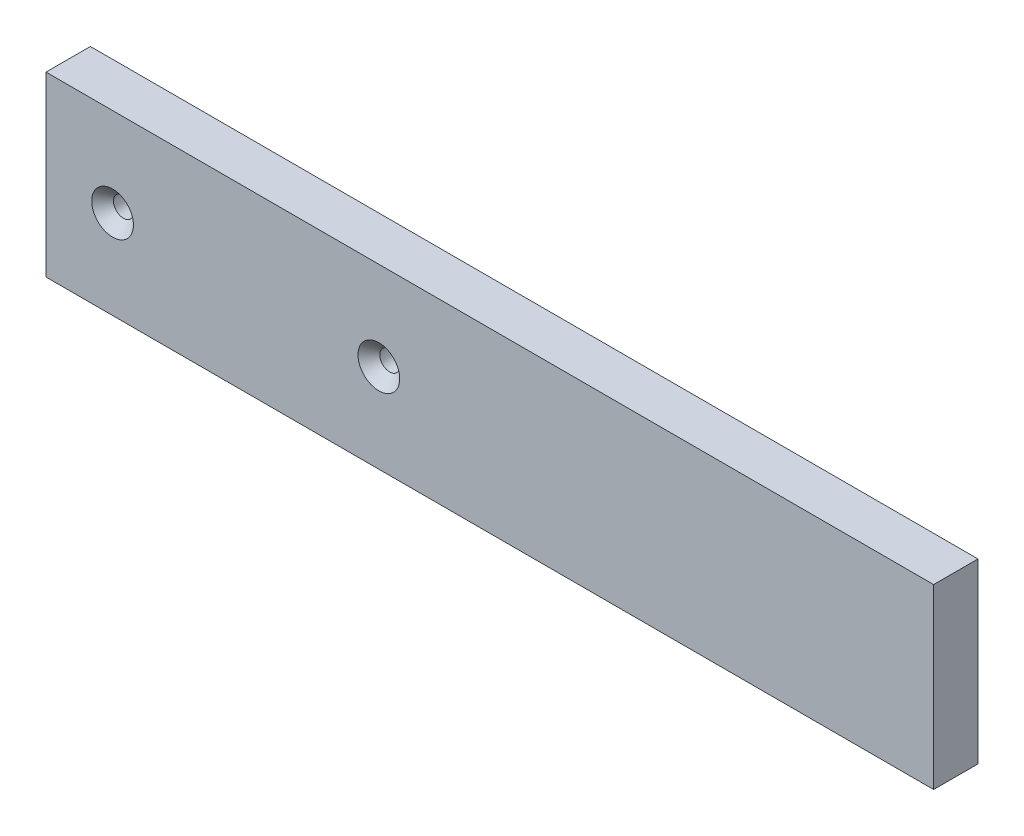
ISO-10303-21;
HEADER;
FILE_DESCRIPTION(('STEP AP214'),'2;1');
FILE_NAME('part.step','',(''),(''),'','','');
FILE_SCHEMA(('AUTOMOTIVE_DESIGN { 1 0 10303 214 1 1 1 1 }'));
ENDSEC;
DATA;
#1=APPLICATION_CONTEXT('core data for automotive mechanical design processes');
#2=APPLICATION_PROTOCOL_DEFINITION('international standard','automotive_design',2000,#1);
#3=PRODUCT_CONTEXT('',#1,'mechanical');
#4=PRODUCT('Part','Part','',(#3));
#5=PRODUCT_RELATED_PRODUCT_CATEGORY('part','',(#4));
#6=PRODUCT_DEFINITION_FORMATION('','',#4);
#7=PRODUCT_DEFINITION_CONTEXT('part definition',#1,'design');
#8=PRODUCT_DEFINITION('design','',#6,#7);
#9=PRODUCT_DEFINITION_SHAPE('','',#8);
#10=(LENGTH_UNIT() NAMED_UNIT(*) SI_UNIT(.MILLI.,.METRE.));
#11=(NAMED_UNIT(*) PLANE_ANGLE_UNIT() SI_UNIT($,.RADIAN.));
#12=(NAMED_UNIT(*) SI_UNIT($,.STERADIAN.) SOLID_ANGLE_UNIT());
#13=UNCERTAINTY_MEASURE_WITH_UNIT(LENGTH_MEASURE(1.E-05),#10,'distance_accuracy_value','');
#14=(GEOMETRIC_REPRESENTATION_CONTEXT(3) GLOBAL_UNCERTAINTY_ASSIGNED_CONTEXT((#13)) GLOBAL_UNIT_ASSIGNED_CONTEXT((#10,
#11,#12)) REPRESENTATION_CONTEXT('',''));
#15=CARTESIAN_POINT('',(0.,0.,0.));
#16=DIRECTION('',(0.,0.,1.));
#17=DIRECTION('',(1.,0.,0.));
#18=AXIS2_PLACEMENT_3D('',#15,#16,#17);
#19=CARTESIAN_POINT('',(100.,20.,5.));
#20=DIRECTION('',(-1.,0.,0.));
#21=DIRECTION('',(0.,0.,1.));
#22=AXIS2_PLACEMENT_3D('',#19,#20,#21);
#23=PLANE('',#22);
#24=DIRECTION('',(0.,1.,0.));
#25=VECTOR('',#24,1.);
#26=CARTESIAN_POINT('',(100.,20.,-5.));
#27=LINE('',#26,#25);
#28=CARTESIAN_POINT('',(100.,-20.,-5.));
#29=VERTEX_POINT('',#28);
#30=CARTESIAN_POINT('',(100.,20.,-5.));
#31=VERTEX_POINT('',#30);
#32=EDGE_CURVE('E106',#29,#31,#27,.T.);
#33=ORIENTED_EDGE('',*,*,#32,.T.);
#34=DIRECTION('',(0.,0.,-1.));
#35=VECTOR('',#34,1.);
#36=CARTESIAN_POINT('',(100.,20.,5.));
#37=LINE('',#36,#35);
#38=CARTESIAN_POINT('',(100.,20.,5.));
#39=VERTEX_POINT('',#38);
#40=EDGE_CURVE('E11',#39,#31,#37,.T.);
#41=ORIENTED_EDGE('',*,*,#40,.F.);
#42=DIRECTION('',(0.,1.,0.));
#43=VECTOR('',#42,1.);
#44=CARTESIAN_POINT('',(100.,20.,5.));
#45=LINE('',#44,#43);
#46=CARTESIAN_POINT('',(100.,-20.,5.));
#47=VERTEX_POINT('',#46);
#48=EDGE_CURVE('E90',#47,#39,#45,.T.);
#49=ORIENTED_EDGE('',*,*,#48,.F.);
#50=DIRECTION('',(0.,0.,-1.));
#51=VECTOR('',#50,1.);
#52=CARTESIAN_POINT('',(100.,-20.,5.));
#53=LINE('',#52,#51);
#54=EDGE_CURVE('E102',#47,#29,#53,.T.);
#55=ORIENTED_EDGE('',*,*,#54,.T.);
#56=EDGE_LOOP('',(#33,#41,#49,#55));
#57=FACE_BOUND('',#56,.T.);
#58=ADVANCED_FACE('F38',(#57),#23,.F.);
#59=CARTESIAN_POINT('',(-100.,20.,5.));
#60=DIRECTION('',(0.,-1.,0.));
#61=DIRECTION('',(0.,0.,-1.));
#62=AXIS2_PLACEMENT_3D('',#59,#60,#61);
#63=PLANE('',#62);
#64=DIRECTION('',(-1.,0.,0.));
#65=VECTOR('',#64,1.);
#66=CARTESIAN_POINT('',(-100.,20.,-5.));
#67=LINE('',#66,#65);
#68=CARTESIAN_POINT('',(-100.,20.,-5.));
#69=VERTEX_POINT('',#68);
#70=EDGE_CURVE('E95',#31,#69,#67,.T.);
#71=ORIENTED_EDGE('',*,*,#70,.T.);
#72=DIRECTION('',(0.,0.,-1.));
#73=VECTOR('',#72,1.);
#74=CARTESIAN_POINT('',(-100.,20.,5.));
#75=LINE('',#74,#73);
#76=CARTESIAN_POINT('',(-100.,20.,5.));
#77=VERTEX_POINT('',#76);
#78=EDGE_CURVE('E47',#77,#69,#75,.T.);
#79=ORIENTED_EDGE('',*,*,#78,.F.);
#80=DIRECTION('',(-1.,0.,0.));
#81=VECTOR('',#80,1.);
#82=CARTESIAN_POINT('',(-100.,20.,5.));
#83=LINE('',#82,#81);
#84=EDGE_CURVE('E85',#39,#77,#83,.T.);
#85=ORIENTED_EDGE('',*,*,#84,.F.);
#86=ORIENTED_EDGE('',*,*,#40,.T.);
#87=EDGE_LOOP('',(#71,#79,#85,#86));
#88=FACE_BOUND('',#87,.T.);
#89=ADVANCED_FACE('F94',(#88),#63,.F.);
#90=CARTESIAN_POINT('',(-100.,20.,5.));
#91=DIRECTION('',(1.,0.,0.));
#92=DIRECTION('',(0.,0.,-1.));
#93=AXIS2_PLACEMENT_3D('',#90,#91,#92);
#94=PLANE('',#93);
#95=DIRECTION('',(0.,-1.,0.));
#96=VECTOR('',#95,1.);
#97=CARTESIAN_POINT('',(-100.,20.,-5.));
#98=LINE('',#97,#96);
#99=CARTESIAN_POINT('',(-100.,-20.,-5.));
#100=VERTEX_POINT('',#99);
#101=EDGE_CURVE('E72',#69,#100,#98,.T.);
#102=ORIENTED_EDGE('',*,*,#101,.T.);
#103=DIRECTION('',(0.,0.,-1.));
#104=VECTOR('',#103,1.);
#105=CARTESIAN_POINT('',(-100.,-20.,5.));
#106=LINE('',#105,#104);
#107=CARTESIAN_POINT('',(-100.,-20.,5.));
#108=VERTEX_POINT('',#107);
#109=EDGE_CURVE('E97',#108,#100,#106,.T.);
#110=ORIENTED_EDGE('',*,*,#109,.F.);
#111=DIRECTION('',(0.,-1.,0.));
#112=VECTOR('',#111,1.);
#113=CARTESIAN_POINT('',(-100.,20.,5.));
#114=LINE('',#113,#112);
#115=EDGE_CURVE('E88',#77,#108,#114,.T.);
#116=ORIENTED_EDGE('',*,*,#115,.F.);
#117=ORIENTED_EDGE('',*,*,#78,.T.);
#118=EDGE_LOOP('',(#102,#110,#116,#117));
#119=FACE_BOUND('',#118,.T.);
#120=ADVANCED_FACE('F98',(#119),#94,.F.);
#121=CARTESIAN_POINT('',(-100.,-20.,5.));
#122=DIRECTION('',(0.,1.,0.));
#123=DIRECTION('',(0.,0.,1.));
#124=AXIS2_PLACEMENT_3D('',#121,#122,#123);
#125=PLANE('',#124);
#126=DIRECTION('',(1.,0.,0.));
#127=VECTOR('',#126,1.);
#128=CARTESIAN_POINT('',(-100.,-20.,-5.));
#129=LINE('',#128,#127);
#130=EDGE_CURVE('E78',#100,#29,#129,.T.);
#131=ORIENTED_EDGE('',*,*,#130,.T.);
#132=ORIENTED_EDGE('',*,*,#54,.F.);
#133=DIRECTION('',(1.,0.,0.));
#134=VECTOR('',#133,1.);
#135=CARTESIAN_POINT('',(-100.,-20.,5.));
#136=LINE('',#135,#134);
#137=EDGE_CURVE('E55',#108,#47,#136,.T.);
#138=ORIENTED_EDGE('',*,*,#137,.F.);
#139=ORIENTED_EDGE('',*,*,#109,.T.);
#140=EDGE_LOOP('',(#131,#132,#138,#139));
#141=FACE_BOUND('',#140,.T.);
#142=ADVANCED_FACE('F120',(#141),#125,.F.);
#143=CARTESIAN_POINT('',(0.,0.,5.));
#144=DIRECTION('',(0.,0.,1.));
#145=DIRECTION('',(1.,0.,0.));
#146=AXIS2_PLACEMENT_3D('',#143,#144,#145);
#147=PLANE('',#146);
#148=CARTESIAN_POINT('',(-24.9999999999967,0.,5.00000000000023));
#149=DIRECTION('',(0.,0.,1.));
#150=DIRECTION('',(1.,0.,0.));
#151=AXIS2_PLACEMENT_3D('',#148,#149,#150);
#152=CIRCLE('',#151,4.7);
#153=CARTESIAN_POINT('',(-20.2999999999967,0.,5.00000000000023));
#154=VERTEX_POINT('',#153);
#155=EDGE_CURVE('E146',#154,#154,#152,.T.);
#156=ORIENTED_EDGE('',*,*,#155,.F.);
#157=EDGE_LOOP('',(#156));
#158=FACE_BOUND('',#157,.T.);
#159=CARTESIAN_POINT('',(-84.9999999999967,0.,5.00000000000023));
#160=DIRECTION('',(0.,0.,1.));
#161=DIRECTION('',(1.,0.,0.));
#162=AXIS2_PLACEMENT_3D('',#159,#160,#161);
#163=CIRCLE('',#162,4.7);
#164=CARTESIAN_POINT('',(-80.2999999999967,0.,5.00000000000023));
#165=VERTEX_POINT('',#164);
#166=EDGE_CURVE('E134',#165,#165,#163,.T.);
#167=ORIENTED_EDGE('',*,*,#166,.F.);
#168=EDGE_LOOP('',(#167));
#169=FACE_BOUND('',#168,.T.);
#170=ORIENTED_EDGE('',*,*,#48,.T.);
#171=ORIENTED_EDGE('',*,*,#84,.T.);
#172=ORIENTED_EDGE('',*,*,#115,.T.);
#173=ORIENTED_EDGE('',*,*,#137,.T.);
#174=EDGE_LOOP('',(#170,#171,#172,#173));
#175=FACE_BOUND('',#174,.T.);
#176=ADVANCED_FACE('F86',(#158,#169,#175),#147,.T.);
#177=CARTESIAN_POINT('',(0.,0.,-5.));
#178=DIRECTION('',(0.,0.,1.));
#179=DIRECTION('',(1.,0.,0.));
#180=AXIS2_PLACEMENT_3D('',#177,#178,#179);
#181=PLANE('',#180);
#182=CARTESIAN_POINT('',(-24.9999999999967,0.,-5.));
#183=DIRECTION('',(0.,0.,1.));
#184=DIRECTION('',(1.,0.,0.));
#185=AXIS2_PLACEMENT_3D('',#182,#183,#184);
#186=CIRCLE('',#185,2.25);
#187=CARTESIAN_POINT('',(-22.7499999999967,0.,-5.));
#188=VERTEX_POINT('',#187);
#189=EDGE_CURVE('E138',#188,#188,#186,.T.);
#190=ORIENTED_EDGE('',*,*,#189,.T.);
#191=EDGE_LOOP('',(#190));
#192=FACE_BOUND('',#191,.T.);
#193=CARTESIAN_POINT('',(-84.9999999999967,0.,-5.));
#194=DIRECTION('',(0.,0.,1.));
#195=DIRECTION('',(1.,0.,0.));
#196=AXIS2_PLACEMENT_3D('',#193,#194,#195);
#197=CIRCLE('',#196,2.25);
#198=CARTESIAN_POINT('',(-82.7499999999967,0.,-5.));
#199=VERTEX_POINT('',#198);
#200=EDGE_CURVE('E110',#199,#199,#197,.T.);
#201=ORIENTED_EDGE('',*,*,#200,.T.);
#202=EDGE_LOOP('',(#201));
#203=FACE_BOUND('',#202,.T.);
#204=ORIENTED_EDGE('',*,*,#32,.F.);
#205=ORIENTED_EDGE('',*,*,#130,.F.);
#206=ORIENTED_EDGE('',*,*,#101,.F.);
#207=ORIENTED_EDGE('',*,*,#70,.F.);
#208=EDGE_LOOP('',(#204,#205,#206,#207));
#209=FACE_BOUND('',#208,.T.);
#210=ADVANCED_FACE('F123',(#192,#203,#209),#181,.F.);
#211=CARTESIAN_POINT('',(-84.9999999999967,0.,5.00000000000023));
#212=DIRECTION('',(0.,0.,1.));
#213=DIRECTION('',(1.,0.,0.));
#214=AXIS2_PLACEMENT_3D('',#211,#212,#213);
#215=CYLINDRICAL_SURFACE('',#214,2.25);
#216=ORIENTED_EDGE('',*,*,#200,.F.);
#217=EDGE_LOOP('',(#216));
#218=FACE_BOUND('',#217,.T.);
#219=CARTESIAN_POINT('',(-84.9999999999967,0.,2.55000000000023));
#220=DIRECTION('',(0.,0.,1.));
#221=DIRECTION('',(1.,0.,0.));
#222=AXIS2_PLACEMENT_3D('',#219,#220,#221);
#223=CIRCLE('',#222,2.25);
#224=CARTESIAN_POINT('',(-82.7499999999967,0.,2.55000000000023));
#225=VERTEX_POINT('',#224);
#226=EDGE_CURVE('E130',#225,#225,#223,.T.);
#227=ORIENTED_EDGE('',*,*,#226,.T.);
#228=EDGE_LOOP('',(#227));
#229=FACE_BOUND('',#228,.T.);
#230=ADVANCED_FACE('F161',(#218,#229),#215,.F.);
#231=CARTESIAN_POINT('',(-84.9999999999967,0.,5.00000000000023));
#232=DIRECTION('',(0.,0.,1.));
#233=DIRECTION('',(1.,0.,0.));
#234=AXIS2_PLACEMENT_3D('',#231,#232,#233);
#235=CONICAL_SURFACE('',#234,4.7,0.785398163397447);
#236=ORIENTED_EDGE('',*,*,#226,.F.);
#237=EDGE_LOOP('',(#236));
#238=FACE_BOUND('',#237,.T.);
#239=ORIENTED_EDGE('',*,*,#166,.T.);
#240=EDGE_LOOP('',(#239));
#241=FACE_BOUND('',#240,.T.);
#242=ADVANCED_FACE('F158',(#238,#241),#235,.F.);
#243=CARTESIAN_POINT('',(-24.9999999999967,0.,5.00000000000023));
#244=DIRECTION('',(0.,0.,1.));
#245=DIRECTION('',(1.,0.,0.));
#246=AXIS2_PLACEMENT_3D('',#243,#244,#245);
#247=CYLINDRICAL_SURFACE('',#246,2.25);
#248=ORIENTED_EDGE('',*,*,#189,.F.);
#249=EDGE_LOOP('',(#248));
#250=FACE_BOUND('',#249,.T.);
#251=CARTESIAN_POINT('',(-24.9999999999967,0.,2.55000000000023));
#252=DIRECTION('',(0.,0.,1.));
#253=DIRECTION('',(1.,0.,0.));
#254=AXIS2_PLACEMENT_3D('',#251,#252,#253);
#255=CIRCLE('',#254,2.25);
#256=CARTESIAN_POINT('',(-22.7499999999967,0.,2.55000000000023));
#257=VERTEX_POINT('',#256);
#258=EDGE_CURVE('E142',#257,#257,#255,.T.);
#259=ORIENTED_EDGE('',*,*,#258,.T.);
#260=EDGE_LOOP('',(#259));
#261=FACE_BOUND('',#260,.T.);
#262=ADVANCED_FACE('F160',(#250,#261),#247,.F.);
#263=CARTESIAN_POINT('',(-24.9999999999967,0.,5.00000000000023));
#264=DIRECTION('',(0.,0.,1.));
#265=DIRECTION('',(1.,0.,0.));
#266=AXIS2_PLACEMENT_3D('',#263,#264,#265);
#267=CONICAL_SURFACE('',#266,4.7,0.785398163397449);
#268=ORIENTED_EDGE('',*,*,#258,.F.);
#269=EDGE_LOOP('',(#268));
#270=FACE_BOUND('',#269,.T.);
#271=ORIENTED_EDGE('',*,*,#155,.T.);
#272=EDGE_LOOP('',(#271));
#273=FACE_BOUND('',#272,.T.);
#274=ADVANCED_FACE('F151',(#270,#273),#267,.F.);
#275=CLOSED_SHELL('',(#58,#89,#120,#142,#176,#210,#230,#242,#262,#274));
#276=MANIFOLD_SOLID_BREP('B2',#275);
#277=ADVANCED_BREP_SHAPE_REPRESENTATION('',(#18,#276),#14);
#278=SHAPE_DEFINITION_REPRESENTATION(#9,#277);
ENDSEC;
END-ISO-10303-21;
